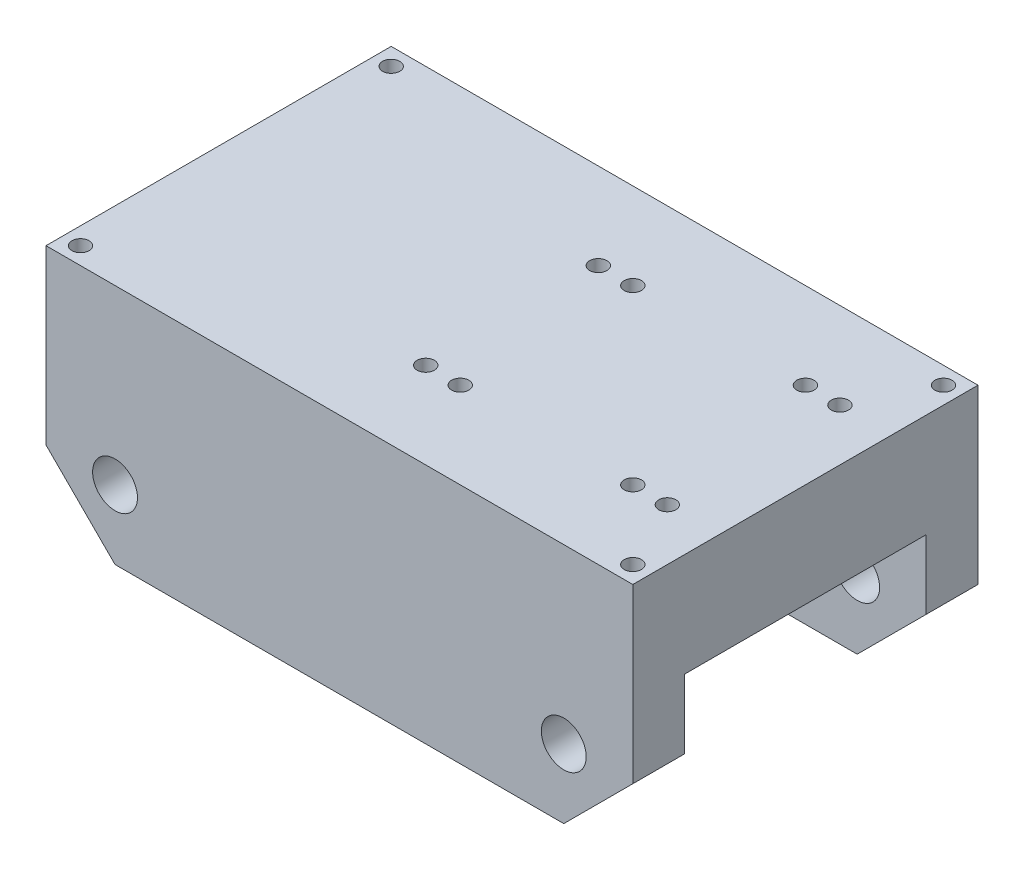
from build123d import *

# Parameters (mm, degrees)
ESQUISSE1_R             = 6.5
BOSS_EXTRU_1_DEPTH      = 100
ESQUISSE2_W             = 70
ESQUISSE2_H             = 44.520014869
ENL_V_MAT_EXTRU_1_DEPTH = 210.284495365
ESQUISSE3_R             = 2.5
ENL_V_MAT_EXTRU_2_DEPTH = 8
ESQUISSE4_R             = 2.5
ENL_V_MAT_EXTRU_3_DEPTH = 13


with BuildPart() as part:
    # Esquisse1 → Boss.-Extru.1 (new body)
    with BuildSketch(Plane.XY):
        Polygon((0, 0), (-130, 0), (-150, 20), (-150, 70), (20, 70), (20, 20), align=None)
        with Locations((-130, 20)):
            Circle(ESQUISSE1_R, mode=Mode.SUBTRACT)
        with Locations((0, 20)):
            Circle(ESQUISSE1_R, mode=Mode.SUBTRACT)
    extrude(amount=BOSS_EXTRU_1_DEPTH)

    # Esquisse2 → Enl_v. mat.-Extru.1 (cut, through all)
    with BuildSketch(Plane(origin=(20, 0, 0), x_dir=(0, 0, -1), z_dir=(1, 0, 0))):
        with Locations((-50, 17.739992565)):
            Rectangle(ESQUISSE2_W, ESQUISSE2_H)
    extrude(amount=-ENL_V_MAT_EXTRU_1_DEPTH, mode=Mode.SUBTRACT)

    # Esquisse3 → Enl_v. mat.-Extru.2 (cut)
    with BuildSketch(Plane(origin=(0, 70, 0), x_dir=(1, 0, 0), z_dir=(0, 1, 0))):
        with Locations(Location((-145, -5, 0), (0, 0, 270))):
            Circle(ESQUISSE3_R)
        with Locations(Location((15, -5, 0), (0, 0, 270))):
            Circle(ESQUISSE3_R)
        with Locations(Location((15, -95, 0), (0, 0, 270))):
            Circle(ESQUISSE3_R)
        with Locations(Location((-145, -95, 0), (0, 0, 270))):
            Circle(ESQUISSE3_R)
    extrude(amount=-ENL_V_MAT_EXTRU_2_DEPTH, mode=Mode.SUBTRACT)

    # Esquisse4 → Enl_v. mat.-Extru.3 (cut)
    with BuildSketch(Plane(origin=(0, 70, 0), x_dir=(1, 0, 0), z_dir=(0, 1, 0))):
        with Locations(Location((-65, -25, 0), (0, 0, 270))):
            Circle(ESQUISSE4_R)
        with Locations(Location((-65, -75, 0), (0, 0, 270))):
            Circle(ESQUISSE4_R)
        with Locations(Location((-5, -75, 0), (0, 0, 270))):
            Circle(ESQUISSE4_R)
        with Locations(Location((5, -75, 0), (0, 0, 270))):
            Circle(ESQUISSE4_R)
        with Locations(Location((5, -25, 0), (0, 0, 270))):
            Circle(ESQUISSE4_R)
        with Locations(Location((-5, -25, 0), (0, 0, 270))):
            Circle(ESQUISSE4_R)
        with Locations(Location((-55, -25, 0), (0, 0, 270))):
            Circle(ESQUISSE4_R)
        with Locations(Location((-55, -75, 0), (0, 0, 270))):
            Circle(ESQUISSE4_R)
    extrude(amount=-ENL_V_MAT_EXTRU_3_DEPTH, mode=Mode.SUBTRACT)


solid = part.part
